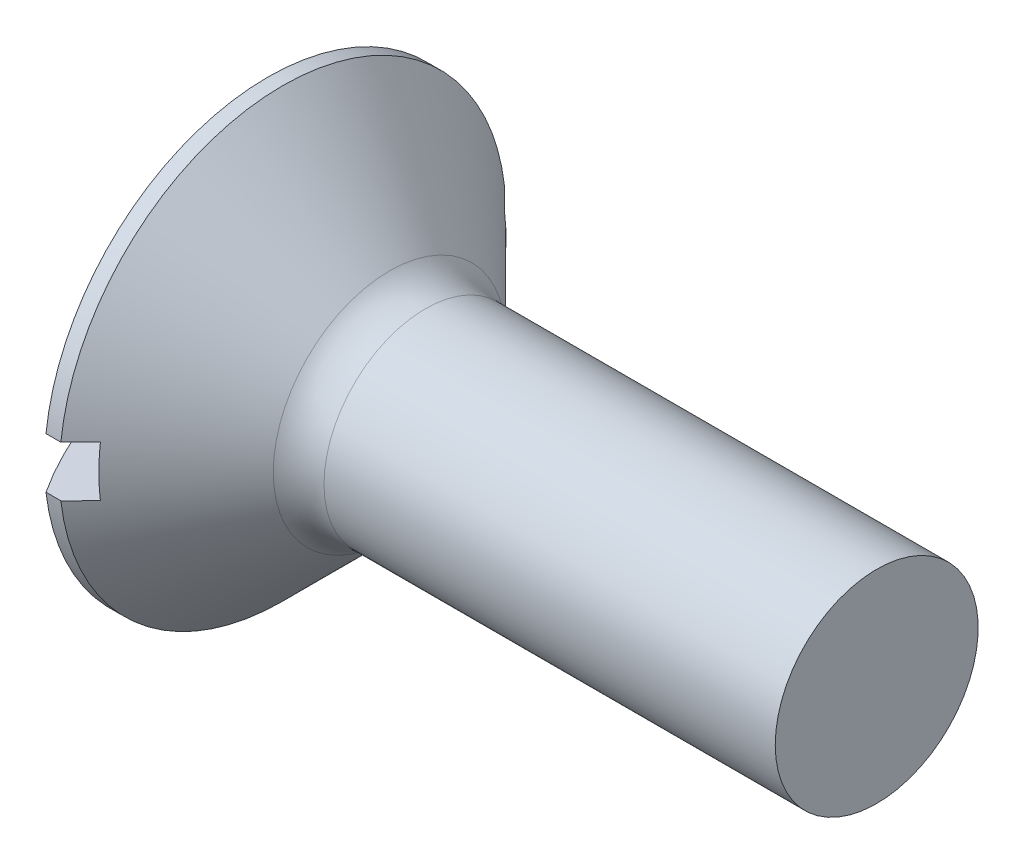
from build123d import *

# Parameters (mm, degrees)
SLOT_DEPTH      = 8.350294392
SLOT_DEPTH_BACK = 8.350294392
SKE_SLOT_W      = 1
SKE_SLOT_H      = 0.5


with BuildPart() as part:
    # Ske-Screw → Base (revolve)
    with BuildSketch(Plane.XY, mode=Mode.PRIVATE) as base_sk:
        with BuildLine():
            Line((0.659341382, 2.2), (0.805787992, 2.2))
            Line((0.805787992, 2.2), (1.859341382, 1.146446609))
            ThreePointArc((1.859341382, 1.146446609), (2.021553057, 1.038060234), (2.212894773, 1))
            Line((2.212894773, 1), (6.659341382, 1))
            Line((6.659341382, 1), (6.659341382, 0))
            Line((6.659341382, 0), (0.659341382, 0))
            Line((0.659341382, 0), (0, 0))
            ThreePointArc((0, 0), (0.168379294, 1.148339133), (0.659341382, 2.2))
        make_face()
    revolve(base_sk.sketch.rotate(Axis((-1.349906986, 0, 0), (1, 0, 0)), 90), axis=Axis((-1.349906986, 0, 0), (1, 0, 0)))

    # Ske-Slot → Slot (cut, two sides: drawn at the far end of the back side and taken through both)
    with BuildSketch(Plane.XY.offset(-SLOT_DEPTH_BACK)):
        with Locations((0.5, 0)):
            Rectangle(SKE_SLOT_W, SKE_SLOT_H)
    extrude(amount=SLOT_DEPTH + SLOT_DEPTH_BACK, mode=Mode.SUBTRACT)


solid = part.part
